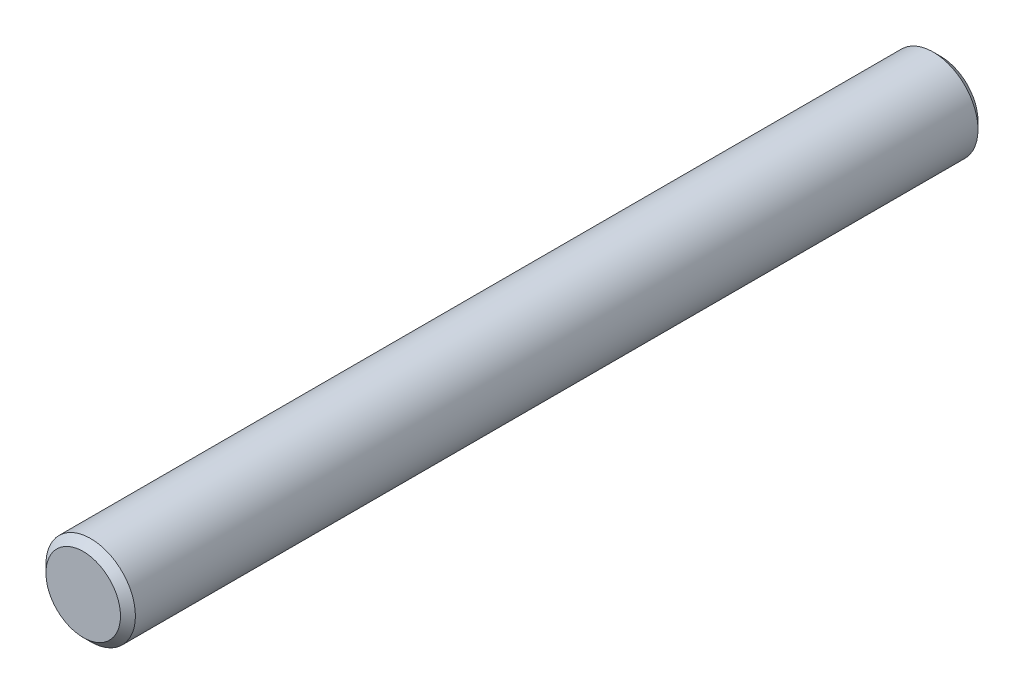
ISO-10303-21;
HEADER;
FILE_DESCRIPTION(('STEP AP214'),'2;1');
FILE_NAME('part.step','',(''),(''),'','','');
FILE_SCHEMA(('AUTOMOTIVE_DESIGN { 1 0 10303 214 1 1 1 1 }'));
ENDSEC;
DATA;
#1=APPLICATION_CONTEXT('core data for automotive mechanical design processes');
#2=APPLICATION_PROTOCOL_DEFINITION('international standard','automotive_design',2000,#1);
#3=PRODUCT_CONTEXT('',#1,'mechanical');
#4=PRODUCT('Part','Part','',(#3));
#5=PRODUCT_RELATED_PRODUCT_CATEGORY('part','',(#4));
#6=PRODUCT_DEFINITION_FORMATION('','',#4);
#7=PRODUCT_DEFINITION_CONTEXT('part definition',#1,'design');
#8=PRODUCT_DEFINITION('design','',#6,#7);
#9=PRODUCT_DEFINITION_SHAPE('','',#8);
#10=(LENGTH_UNIT() NAMED_UNIT(*) SI_UNIT(.MILLI.,.METRE.));
#11=(NAMED_UNIT(*) PLANE_ANGLE_UNIT() SI_UNIT($,.RADIAN.));
#12=(NAMED_UNIT(*) SI_UNIT($,.STERADIAN.) SOLID_ANGLE_UNIT());
#13=UNCERTAINTY_MEASURE_WITH_UNIT(LENGTH_MEASURE(1.E-05),#10,'distance_accuracy_value','');
#14=(GEOMETRIC_REPRESENTATION_CONTEXT(3) GLOBAL_UNCERTAINTY_ASSIGNED_CONTEXT((#13)) GLOBAL_UNIT_ASSIGNED_CONTEXT((#10,
#11,#12)) REPRESENTATION_CONTEXT('',''));
#15=CARTESIAN_POINT('',(0.,0.,0.));
#16=DIRECTION('',(0.,0.,1.));
#17=DIRECTION('',(1.,0.,0.));
#18=AXIS2_PLACEMENT_3D('',#15,#16,#17);
#19=CARTESIAN_POINT('',(0.,0.,115.));
#20=DIRECTION('',(0.,0.,-1.));
#21=DIRECTION('',(-1.,0.,0.));
#22=AXIS2_PLACEMENT_3D('',#19,#20,#21);
#23=CYLINDRICAL_SURFACE('',#22,6.);
#24=CARTESIAN_POINT('',(0.,0.,0.999999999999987));
#25=DIRECTION('',(0.,0.,1.));
#26=DIRECTION('',(1.,0.,0.));
#27=AXIS2_PLACEMENT_3D('',#24,#25,#26);
#28=CIRCLE('',#27,6.);
#29=CARTESIAN_POINT('',(6.,0.,0.999999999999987));
#30=VERTEX_POINT('',#29);
#31=EDGE_CURVE('E44',#30,#30,#28,.T.);
#32=ORIENTED_EDGE('',*,*,#31,.T.);
#33=EDGE_LOOP('',(#32));
#34=FACE_BOUND('',#33,.T.);
#35=CARTESIAN_POINT('',(0.,0.,114.));
#36=DIRECTION('',(0.,0.,1.));
#37=DIRECTION('',(1.,0.,0.));
#38=AXIS2_PLACEMENT_3D('',#35,#36,#37);
#39=CIRCLE('',#38,6.);
#40=CARTESIAN_POINT('',(6.,0.,114.));
#41=VERTEX_POINT('',#40);
#42=EDGE_CURVE('E48',#41,#41,#39,.F.);
#43=ORIENTED_EDGE('',*,*,#42,.T.);
#44=EDGE_LOOP('',(#43));
#45=FACE_BOUND('',#44,.T.);
#46=ADVANCED_FACE('F33',(#34,#45),#23,.T.);
#47=CARTESIAN_POINT('',(0.,0.,115.));
#48=DIRECTION('',(0.,0.,1.));
#49=DIRECTION('',(1.,0.,0.));
#50=AXIS2_PLACEMENT_3D('',#47,#48,#49);
#51=PLANE('',#50);
#52=CARTESIAN_POINT('',(0.,0.,115.));
#53=DIRECTION('',(0.,0.,1.));
#54=DIRECTION('',(1.,0.,0.));
#55=AXIS2_PLACEMENT_3D('',#52,#53,#54);
#56=CIRCLE('',#55,5.);
#57=CARTESIAN_POINT('',(5.,0.,115.));
#58=VERTEX_POINT('',#57);
#59=EDGE_CURVE('E10',#58,#58,#56,.T.);
#60=ORIENTED_EDGE('',*,*,#59,.T.);
#61=EDGE_LOOP('',(#60));
#62=FACE_BOUND('',#61,.T.);
#63=ADVANCED_FACE('F64',(#62),#51,.T.);
#64=CARTESIAN_POINT('',(0.,0.,0.));
#65=DIRECTION('',(0.,0.,1.));
#66=DIRECTION('',(1.,0.,0.));
#67=AXIS2_PLACEMENT_3D('',#64,#65,#66);
#68=PLANE('',#67);
#69=CARTESIAN_POINT('',(0.,0.,0.));
#70=DIRECTION('',(0.,0.,1.));
#71=DIRECTION('',(1.,0.,0.));
#72=AXIS2_PLACEMENT_3D('',#69,#70,#71);
#73=CIRCLE('',#72,4.99999999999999);
#74=CARTESIAN_POINT('',(4.99999999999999,0.,0.));
#75=VERTEX_POINT('',#74);
#76=EDGE_CURVE('E40',#75,#75,#73,.F.);
#77=ORIENTED_EDGE('',*,*,#76,.T.);
#78=EDGE_LOOP('',(#77));
#79=FACE_BOUND('',#78,.T.);
#80=ADVANCED_FACE('F61',(#79),#68,.F.);
#81=CARTESIAN_POINT('',(0.,0.,0.999999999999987));
#82=DIRECTION('',(0.,0.,1.));
#83=DIRECTION('',(1.,0.,0.));
#84=AXIS2_PLACEMENT_3D('',#81,#82,#83);
#85=CONICAL_SURFACE('',#84,6.,0.78539816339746);
#86=ORIENTED_EDGE('',*,*,#76,.F.);
#87=EDGE_LOOP('',(#86));
#88=FACE_BOUND('',#87,.T.);
#89=ORIENTED_EDGE('',*,*,#31,.F.);
#90=EDGE_LOOP('',(#89));
#91=FACE_BOUND('',#90,.T.);
#92=ADVANCED_FACE('F57',(#88,#91),#85,.T.);
#93=CARTESIAN_POINT('',(0.,0.,115.));
#94=DIRECTION('',(0.,0.,-1.));
#95=DIRECTION('',(-1.,0.,0.));
#96=AXIS2_PLACEMENT_3D('',#93,#94,#95);
#97=CONICAL_SURFACE('',#96,5.,0.785398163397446);
#98=ORIENTED_EDGE('',*,*,#42,.F.);
#99=EDGE_LOOP('',(#98));
#100=FACE_BOUND('',#99,.T.);
#101=ORIENTED_EDGE('',*,*,#59,.F.);
#102=EDGE_LOOP('',(#101));
#103=FACE_BOUND('',#102,.T.);
#104=ADVANCED_FACE('F35',(#100,#103),#97,.T.);
#105=CLOSED_SHELL('',(#46,#63,#80,#92,#104));
#106=MANIFOLD_SOLID_BREP('B2',#105);
#107=ADVANCED_BREP_SHAPE_REPRESENTATION('',(#18,#106),#14);
#108=SHAPE_DEFINITION_REPRESENTATION(#9,#107);
ENDSEC;
END-ISO-10303-21;
